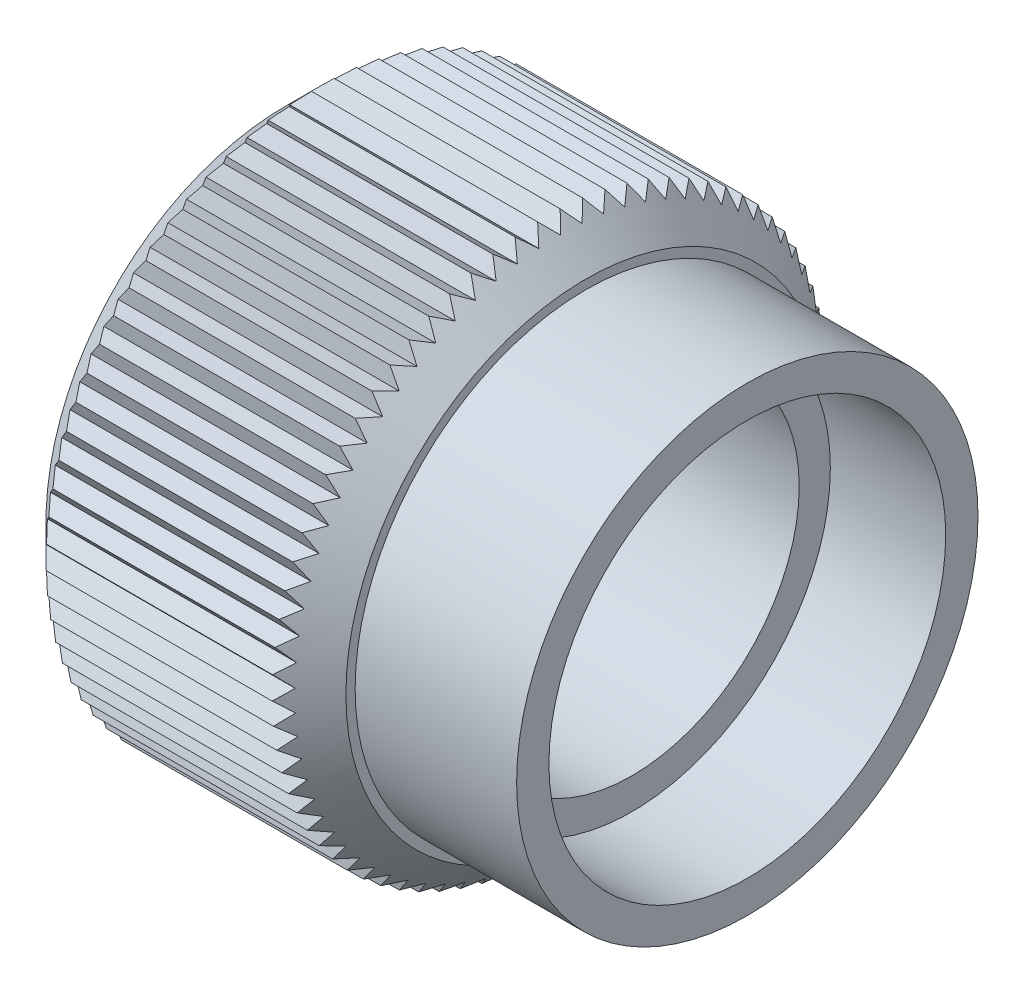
from build123d import *

# Parameters (mm, degrees)
M8X0_75_GEWINDEBOHRUNG1_D       = 7.25
FASE1_SIZE                      = 0.8
SCHNITT_LINEAR_AUSTRAGEN1_DEPTH = 14.114877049
KREISMUSTER1_COUNT              = 77


with BuildPart() as part:
    # Skizze1 → Rotation1 (revolve)
    with BuildSketch(Plane.XY, mode=Mode.PRIVATE) as rotation1_sk:
        Polygon((0, 6), (6.5, 6), (6.5, 5), (10, 5), (10, 4.3), (7.5, 4.3), (7.5, 3.5), (4, 3.5), (4, 5), (0, 5), align=None)
    revolve(rotation1_sk.sketch.rotate(Axis((0, 0, 0), (1, 0, 0)), 90), axis=Axis((0, 0, 0), (1, 0, 0)))

    # M8x0.75 Gewindebohrung1 (through all)
    with Locations(Plane(origin=(7.5, 0, 0), x_dir=(0, 0, -1), z_dir=(1, 0, 0))):
        with Locations((0, 0)):
            Hole(M8X0_75_GEWINDEBOHRUNG1_D / 2)

    # Fase1
    fase1_edges = [part.edges().sort_by_distance(p)[0] for p in [
        (6.5, 0, -6),
        (0, 0, -6),
    ]]
    chamfer(fase1_edges, length=FASE1_SIZE)

    # Skizze4 → Schnitt-Linear austragen1 (cut, through all)
    with BuildSketch(Plane(origin=(0, 0, 0), x_dir=(0, 0, -1), z_dir=(1, 0, 0))):
        with BuildLine():
            Line((-0.244995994, 5.994995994), (0, 5.75))
            Line((0, 5.75), (0.244995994, 5.994995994))
            ThreePointArc((0.244995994, 5.994995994), (0, 6), (-0.244995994, 5.994995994))
        make_face()
    schnitt_linear_austragen1 = extrude(amount=SCHNITT_LINEAR_AUSTRAGEN1_DEPTH, mode=Mode.SUBTRACT)

    # Kreismuster1: Schnitt-Linear austragen1 ×77 about axis
    kreismuster1_axis = Axis((0, 0, 0), (1, 0, 0))
    for i in range(1, KREISMUSTER1_COUNT):
        add(schnitt_linear_austragen1.rotate(kreismuster1_axis, i * 360 / KREISMUSTER1_COUNT), mode=Mode.SUBTRACT)


solid = part.part
